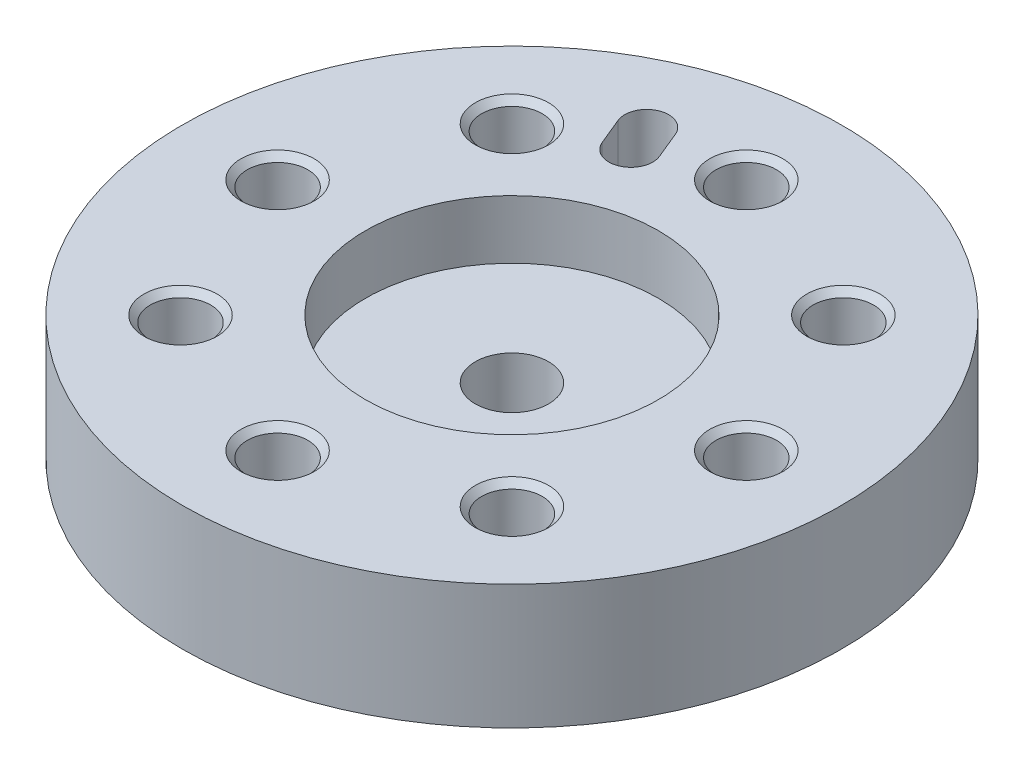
ISO-10303-21;
HEADER;
FILE_DESCRIPTION(('STEP AP214'),'2;1');
FILE_NAME('part.step','',(''),(''),'','','');
FILE_SCHEMA(('AUTOMOTIVE_DESIGN { 1 0 10303 214 1 1 1 1 }'));
ENDSEC;
DATA;
#1=APPLICATION_CONTEXT('core data for automotive mechanical design processes');
#2=APPLICATION_PROTOCOL_DEFINITION('international standard','automotive_design',2000,#1);
#3=PRODUCT_CONTEXT('',#1,'mechanical');
#4=PRODUCT('Part','Part','',(#3));
#5=PRODUCT_RELATED_PRODUCT_CATEGORY('part','',(#4));
#6=PRODUCT_DEFINITION_FORMATION('','',#4);
#7=PRODUCT_DEFINITION_CONTEXT('part definition',#1,'design');
#8=PRODUCT_DEFINITION('design','',#6,#7);
#9=PRODUCT_DEFINITION_SHAPE('','',#8);
#10=(LENGTH_UNIT() NAMED_UNIT(*) SI_UNIT(.MILLI.,.METRE.));
#11=(NAMED_UNIT(*) PLANE_ANGLE_UNIT() SI_UNIT($,.RADIAN.));
#12=(NAMED_UNIT(*) SI_UNIT($,.STERADIAN.) SOLID_ANGLE_UNIT());
#13=UNCERTAINTY_MEASURE_WITH_UNIT(LENGTH_MEASURE(1.E-05),#10,'distance_accuracy_value','');
#14=(GEOMETRIC_REPRESENTATION_CONTEXT(3) GLOBAL_UNCERTAINTY_ASSIGNED_CONTEXT((#13)) GLOBAL_UNIT_ASSIGNED_CONTEXT((#10,
#11,#12)) REPRESENTATION_CONTEXT('',''));
#15=CARTESIAN_POINT('',(0.,0.,0.));
#16=DIRECTION('',(0.,0.,1.));
#17=DIRECTION('',(1.,0.,0.));
#18=AXIS2_PLACEMENT_3D('',#15,#16,#17);
#19=CARTESIAN_POINT('',(0.,-8.,-16.));
#20=DIRECTION('',(0.,1.,0.));
#21=DIRECTION('',(0.,0.,1.));
#22=AXIS2_PLACEMENT_3D('',#19,#20,#21);
#23=PLANE('',#22);
#24=CARTESIAN_POINT('',(0.,-8.,-16.));
#25=DIRECTION('',(0.,-1.,0.));
#26=DIRECTION('',(0.,0.,-1.));
#27=AXIS2_PLACEMENT_3D('',#24,#25,#26);
#28=CIRCLE('',#27,2.067);
#29=CARTESIAN_POINT('',(0.,-8.,-18.067));
#30=VERTEX_POINT('',#29);
#31=EDGE_CURVE('E20',#30,#30,#28,.F.);
#32=ORIENTED_EDGE('',*,*,#31,.T.);
#33=EDGE_LOOP('',(#32));
#34=FACE_BOUND('',#33,.T.);
#35=ADVANCED_FACE('F17',(#34),#23,.T.);
#36=CARTESIAN_POINT('',(-16.,-8.,0.));
#37=DIRECTION('',(0.,1.,0.));
#38=DIRECTION('',(0.,0.,1.));
#39=AXIS2_PLACEMENT_3D('',#36,#37,#38);
#40=PLANE('',#39);
#41=CARTESIAN_POINT('',(-16.,-8.,0.));
#42=DIRECTION('',(0.,-1.,0.));
#43=DIRECTION('',(0.,0.,-1.));
#44=AXIS2_PLACEMENT_3D('',#41,#42,#43);
#45=CIRCLE('',#44,2.067);
#46=CARTESIAN_POINT('',(-16.,-8.,-2.067));
#47=VERTEX_POINT('',#46);
#48=EDGE_CURVE('E171',#47,#47,#45,.F.);
#49=ORIENTED_EDGE('',*,*,#48,.T.);
#50=EDGE_LOOP('',(#49));
#51=FACE_BOUND('',#50,.T.);
#52=ADVANCED_FACE('F300',(#51),#40,.T.);
#53=CARTESIAN_POINT('',(0.,-8.,16.));
#54=DIRECTION('',(0.,1.,0.));
#55=DIRECTION('',(0.,0.,1.));
#56=AXIS2_PLACEMENT_3D('',#53,#54,#55);
#57=PLANE('',#56);
#58=CARTESIAN_POINT('',(0.,-8.,16.));
#59=DIRECTION('',(0.,-1.,0.));
#60=DIRECTION('',(0.,0.,-1.));
#61=AXIS2_PLACEMENT_3D('',#58,#59,#60);
#62=CIRCLE('',#61,2.067);
#63=CARTESIAN_POINT('',(0.,-8.,13.933));
#64=VERTEX_POINT('',#63);
#65=EDGE_CURVE('E169',#64,#64,#62,.F.);
#66=ORIENTED_EDGE('',*,*,#65,.T.);
#67=EDGE_LOOP('',(#66));
#68=FACE_BOUND('',#67,.T.);
#69=ADVANCED_FACE('F297',(#68),#57,.T.);
#70=CARTESIAN_POINT('',(16.,-8.,0.));
#71=DIRECTION('',(0.,1.,0.));
#72=DIRECTION('',(0.,0.,1.));
#73=AXIS2_PLACEMENT_3D('',#70,#71,#72);
#74=PLANE('',#73);
#75=CARTESIAN_POINT('',(16.,-8.,0.));
#76=DIRECTION('',(0.,-1.,0.));
#77=DIRECTION('',(0.,0.,-1.));
#78=AXIS2_PLACEMENT_3D('',#75,#76,#77);
#79=CIRCLE('',#78,2.067);
#80=CARTESIAN_POINT('',(16.,-8.,-2.067));
#81=VERTEX_POINT('',#80);
#82=EDGE_CURVE('E166',#81,#81,#79,.F.);
#83=ORIENTED_EDGE('',*,*,#82,.T.);
#84=EDGE_LOOP('',(#83));
#85=FACE_BOUND('',#84,.T.);
#86=ADVANCED_FACE('F293',(#85),#74,.T.);
#87=CARTESIAN_POINT('',(11.3137084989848,-8.,11.3137084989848));
#88=DIRECTION('',(0.,1.,0.));
#89=DIRECTION('',(0.,0.,1.));
#90=AXIS2_PLACEMENT_3D('',#87,#88,#89);
#91=PLANE('',#90);
#92=CARTESIAN_POINT('',(11.3137084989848,-8.,11.3137084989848));
#93=DIRECTION('',(0.,-1.,0.));
#94=DIRECTION('',(0.,0.,-1.));
#95=AXIS2_PLACEMENT_3D('',#92,#93,#94);
#96=CIRCLE('',#95,2.067);
#97=CARTESIAN_POINT('',(11.3137084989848,-8.,9.24670849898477));
#98=VERTEX_POINT('',#97);
#99=EDGE_CURVE('E163',#98,#98,#96,.F.);
#100=ORIENTED_EDGE('',*,*,#99,.T.);
#101=EDGE_LOOP('',(#100));
#102=FACE_BOUND('',#101,.T.);
#103=ADVANCED_FACE('F289',(#102),#91,.T.);
#104=CARTESIAN_POINT('',(-11.3137084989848,-8.,11.3137084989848));
#105=DIRECTION('',(0.,1.,0.));
#106=DIRECTION('',(0.,0.,1.));
#107=AXIS2_PLACEMENT_3D('',#104,#105,#106);
#108=PLANE('',#107);
#109=CARTESIAN_POINT('',(-11.3137084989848,-8.,11.3137084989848));
#110=DIRECTION('',(0.,-1.,0.));
#111=DIRECTION('',(0.,0.,-1.));
#112=AXIS2_PLACEMENT_3D('',#109,#110,#111);
#113=CIRCLE('',#112,2.067);
#114=CARTESIAN_POINT('',(-11.3137084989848,-8.,9.24670849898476));
#115=VERTEX_POINT('',#114);
#116=EDGE_CURVE('E160',#115,#115,#113,.F.);
#117=ORIENTED_EDGE('',*,*,#116,.T.);
#118=EDGE_LOOP('',(#117));
#119=FACE_BOUND('',#118,.T.);
#120=ADVANCED_FACE('F285',(#119),#108,.T.);
#121=CARTESIAN_POINT('',(-11.3137084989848,-8.,-11.3137084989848));
#122=DIRECTION('',(0.,1.,0.));
#123=DIRECTION('',(0.,0.,1.));
#124=AXIS2_PLACEMENT_3D('',#121,#122,#123);
#125=PLANE('',#124);
#126=CARTESIAN_POINT('',(-11.3137084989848,-8.,-11.3137084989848));
#127=DIRECTION('',(0.,-1.,0.));
#128=DIRECTION('',(0.,0.,-1.));
#129=AXIS2_PLACEMENT_3D('',#126,#127,#128);
#130=CIRCLE('',#129,2.067);
#131=CARTESIAN_POINT('',(-11.3137084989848,-8.,-13.3807084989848));
#132=VERTEX_POINT('',#131);
#133=EDGE_CURVE('E157',#132,#132,#130,.F.);
#134=ORIENTED_EDGE('',*,*,#133,.T.);
#135=EDGE_LOOP('',(#134));
#136=FACE_BOUND('',#135,.T.);
#137=ADVANCED_FACE('F281',(#136),#125,.T.);
#138=CARTESIAN_POINT('',(11.3137084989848,-8.,-11.3137084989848));
#139=DIRECTION('',(0.,1.,0.));
#140=DIRECTION('',(0.,0.,1.));
#141=AXIS2_PLACEMENT_3D('',#138,#139,#140);
#142=PLANE('',#141);
#143=CARTESIAN_POINT('',(11.3137084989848,-8.,-11.3137084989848));
#144=DIRECTION('',(0.,-1.,0.));
#145=DIRECTION('',(0.,0.,-1.));
#146=AXIS2_PLACEMENT_3D('',#143,#144,#145);
#147=CIRCLE('',#146,2.067);
#148=CARTESIAN_POINT('',(11.3137084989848,-8.,-13.3807084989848));
#149=VERTEX_POINT('',#148);
#150=EDGE_CURVE('E67',#149,#149,#147,.F.);
#151=ORIENTED_EDGE('',*,*,#150,.T.);
#152=EDGE_LOOP('',(#151));
#153=FACE_BOUND('',#152,.T.);
#154=ADVANCED_FACE('F278',(#153),#142,.T.);
#155=CARTESIAN_POINT('',(-6.50561835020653,-3.5,-15.7059520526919));
#156=DIRECTION('',(0.,1.,0.));
#157=DIRECTION('',(0.,0.,1.));
#158=AXIS2_PLACEMENT_3D('',#155,#156,#157);
#159=PLANE('',#158);
#160=CARTESIAN_POINT('',(-5.74025148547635,-3.5,-13.8581929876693));
#161=DIRECTION('',(0.,1.,0.));
#162=DIRECTION('',(0.,0.,1.));
#163=AXIS2_PLACEMENT_3D('',#160,#161,#162);
#164=CIRCLE('',#163,1.5);
#165=CARTESIAN_POINT('',(-7.12607078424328,-3.5,-13.2841678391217));
#166=VERTEX_POINT('',#165);
#167=CARTESIAN_POINT('',(-4.35443218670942,-3.5,-14.4322181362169));
#168=VERTEX_POINT('',#167);
#169=EDGE_CURVE('E56',#166,#168,#164,.T.);
#170=ORIENTED_EDGE('',*,*,#169,.T.);
#171=DIRECTION('',(-0.38268343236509,0.,-0.923879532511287));
#172=VECTOR('',#171,1.);
#173=CARTESIAN_POINT('',(-4.35443218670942,-3.5,-14.4322181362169));
#174=LINE('',#173,#172);
#175=CARTESIAN_POINT('',(-5.1197990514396,-3.5,-16.2799772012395));
#176=VERTEX_POINT('',#175);
#177=EDGE_CURVE('E59',#168,#176,#174,.T.);
#178=ORIENTED_EDGE('',*,*,#177,.T.);
#179=CARTESIAN_POINT('',(-6.50561835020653,-3.5,-15.7059520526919));
#180=DIRECTION('',(0.,1.,0.));
#181=DIRECTION('',(0.,0.,1.));
#182=AXIS2_PLACEMENT_3D('',#179,#180,#181);
#183=CIRCLE('',#182,1.5);
#184=CARTESIAN_POINT('',(-7.89143764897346,-3.5,-15.1319269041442));
#185=VERTEX_POINT('',#184);
#186=EDGE_CURVE('E153',#176,#185,#183,.T.);
#187=ORIENTED_EDGE('',*,*,#186,.T.);
#188=DIRECTION('',(0.38268343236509,0.,0.923879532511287));
#189=VECTOR('',#188,1.);
#190=CARTESIAN_POINT('',(-7.89143764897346,-3.5,-15.1319269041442));
#191=LINE('',#190,#189);
#192=EDGE_CURVE('E61',#185,#166,#191,.T.);
#193=ORIENTED_EDGE('',*,*,#192,.T.);
#194=EDGE_LOOP('',(#170,#178,#187,#193));
#195=FACE_BOUND('',#194,.T.);
#196=ADVANCED_FACE('F58',(#195),#159,.T.);
#197=CARTESIAN_POINT('',(0.,0.,-16.));
#198=DIRECTION('',(0.,-1.,0.));
#199=DIRECTION('',(0.,0.,-1.));
#200=AXIS2_PLACEMENT_3D('',#197,#198,#199);
#201=CYLINDRICAL_SURFACE('',#200,2.067);
#202=ORIENTED_EDGE('',*,*,#31,.F.);
#203=EDGE_LOOP('',(#202));
#204=FACE_BOUND('',#203,.T.);
#205=CARTESIAN_POINT('',(0.,-0.432999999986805,-16.));
#206=DIRECTION('',(0.,1.,0.));
#207=DIRECTION('',(0.,0.,1.));
#208=AXIS2_PLACEMENT_3D('',#205,#206,#207);
#209=CIRCLE('',#208,2.06699999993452);
#210=CARTESIAN_POINT('',(0.,-0.432999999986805,-13.9330000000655));
#211=VERTEX_POINT('',#210);
#212=EDGE_CURVE('E105',#211,#211,#209,.T.);
#213=ORIENTED_EDGE('',*,*,#212,.T.);
#214=EDGE_LOOP('',(#213));
#215=FACE_BOUND('',#214,.T.);
#216=ADVANCED_FACE('F179',(#204,#215),#201,.F.);
#217=CARTESIAN_POINT('',(-16.,0.,0.));
#218=DIRECTION('',(0.,-1.,0.));
#219=DIRECTION('',(0.,0.,-1.));
#220=AXIS2_PLACEMENT_3D('',#217,#218,#219);
#221=CYLINDRICAL_SURFACE('',#220,2.067);
#222=ORIENTED_EDGE('',*,*,#48,.F.);
#223=EDGE_LOOP('',(#222));
#224=FACE_BOUND('',#223,.T.);
#225=CARTESIAN_POINT('',(-16.,-0.432999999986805,0.));
#226=DIRECTION('',(0.,1.,0.));
#227=DIRECTION('',(0.,0.,1.));
#228=AXIS2_PLACEMENT_3D('',#225,#226,#227);
#229=CIRCLE('',#228,2.06700000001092);
#230=CARTESIAN_POINT('',(-16.,-0.432999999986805,2.06700000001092));
#231=VERTEX_POINT('',#230);
#232=EDGE_CURVE('E102',#231,#231,#229,.T.);
#233=ORIENTED_EDGE('',*,*,#232,.T.);
#234=EDGE_LOOP('',(#233));
#235=FACE_BOUND('',#234,.T.);
#236=ADVANCED_FACE('F182',(#224,#235),#221,.F.);
#237=CARTESIAN_POINT('',(0.,0.,16.));
#238=DIRECTION('',(0.,-1.,0.));
#239=DIRECTION('',(0.,0.,-1.));
#240=AXIS2_PLACEMENT_3D('',#237,#238,#239);
#241=CYLINDRICAL_SURFACE('',#240,2.067);
#242=ORIENTED_EDGE('',*,*,#65,.F.);
#243=EDGE_LOOP('',(#242));
#244=FACE_BOUND('',#243,.T.);
#245=CARTESIAN_POINT('',(0.,-0.432999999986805,16.));
#246=DIRECTION('',(0.,1.,0.));
#247=DIRECTION('',(0.,0.,1.));
#248=AXIS2_PLACEMENT_3D('',#245,#246,#247);
#249=CIRCLE('',#248,2.06699999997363);
#250=CARTESIAN_POINT('',(0.,-0.432999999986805,18.0669999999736));
#251=VERTEX_POINT('',#250);
#252=EDGE_CURVE('E99',#251,#251,#249,.T.);
#253=ORIENTED_EDGE('',*,*,#252,.T.);
#254=EDGE_LOOP('',(#253));
#255=FACE_BOUND('',#254,.T.);
#256=ADVANCED_FACE('F259',(#244,#255),#241,.F.);
#257=CARTESIAN_POINT('',(16.,0.,0.));
#258=DIRECTION('',(0.,-1.,0.));
#259=DIRECTION('',(0.,0.,-1.));
#260=AXIS2_PLACEMENT_3D('',#257,#258,#259);
#261=CYLINDRICAL_SURFACE('',#260,2.067);
#262=ORIENTED_EDGE('',*,*,#82,.F.);
#263=EDGE_LOOP('',(#262));
#264=FACE_BOUND('',#263,.T.);
#265=CARTESIAN_POINT('',(16.,-0.432999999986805,0.));
#266=DIRECTION('',(0.,1.,0.));
#267=DIRECTION('',(0.,0.,1.));
#268=AXIS2_PLACEMENT_3D('',#265,#266,#267);
#269=CIRCLE('',#268,2.06699999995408);
#270=CARTESIAN_POINT('',(16.,-0.432999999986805,2.06699999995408));
#271=VERTEX_POINT('',#270);
#272=EDGE_CURVE('E96',#271,#271,#269,.T.);
#273=ORIENTED_EDGE('',*,*,#272,.T.);
#274=EDGE_LOOP('',(#273));
#275=FACE_BOUND('',#274,.T.);
#276=ADVANCED_FACE('F261',(#264,#275),#261,.F.);
#277=CARTESIAN_POINT('',(11.3137084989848,0.,11.3137084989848));
#278=DIRECTION('',(0.,-1.,0.));
#279=DIRECTION('',(0.,0.,-1.));
#280=AXIS2_PLACEMENT_3D('',#277,#278,#279);
#281=CYLINDRICAL_SURFACE('',#280,2.067);
#282=ORIENTED_EDGE('',*,*,#99,.F.);
#283=EDGE_LOOP('',(#282));
#284=FACE_BOUND('',#283,.T.);
#285=CARTESIAN_POINT('',(11.3137084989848,-0.432999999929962,11.3137084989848));
#286=DIRECTION('',(0.,1.,0.));
#287=DIRECTION('',(0.,0.,1.));
#288=AXIS2_PLACEMENT_3D('',#285,#286,#287);
#289=CIRCLE('',#288,2.06700000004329);
#290=CARTESIAN_POINT('',(11.3137084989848,-0.432999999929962,13.3807084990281));
#291=VERTEX_POINT('',#290);
#292=EDGE_CURVE('E93',#291,#291,#289,.T.);
#293=ORIENTED_EDGE('',*,*,#292,.T.);
#294=EDGE_LOOP('',(#293));
#295=FACE_BOUND('',#294,.T.);
#296=ADVANCED_FACE('F268',(#284,#295),#281,.F.);
#297=CARTESIAN_POINT('',(-11.3137084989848,0.,11.3137084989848));
#298=DIRECTION('',(0.,-1.,0.));
#299=DIRECTION('',(0.,0.,-1.));
#300=AXIS2_PLACEMENT_3D('',#297,#298,#299);
#301=CYLINDRICAL_SURFACE('',#300,2.067);
#302=ORIENTED_EDGE('',*,*,#116,.F.);
#303=EDGE_LOOP('',(#302));
#304=FACE_BOUND('',#303,.T.);
#305=CARTESIAN_POINT('',(-11.3137084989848,-0.432999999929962,11.3137084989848));
#306=DIRECTION('',(0.,1.,0.));
#307=DIRECTION('',(0.,0.,1.));
#308=AXIS2_PLACEMENT_3D('',#305,#306,#307);
#309=CIRCLE('',#308,2.0670000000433);
#310=CARTESIAN_POINT('',(-11.3137084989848,-0.432999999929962,13.3807084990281));
#311=VERTEX_POINT('',#310);
#312=EDGE_CURVE('E90',#311,#311,#309,.T.);
#313=ORIENTED_EDGE('',*,*,#312,.T.);
#314=EDGE_LOOP('',(#313));
#315=FACE_BOUND('',#314,.T.);
#316=ADVANCED_FACE('F391',(#304,#315),#301,.F.);
#317=CARTESIAN_POINT('',(-11.3137084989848,0.,-11.3137084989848));
#318=DIRECTION('',(0.,-1.,0.));
#319=DIRECTION('',(0.,0.,-1.));
#320=AXIS2_PLACEMENT_3D('',#317,#318,#319);
#321=CYLINDRICAL_SURFACE('',#320,2.067);
#322=ORIENTED_EDGE('',*,*,#133,.F.);
#323=EDGE_LOOP('',(#322));
#324=FACE_BOUND('',#323,.T.);
#325=CARTESIAN_POINT('',(-11.3137084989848,-0.432999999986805,-11.3137084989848));
#326=DIRECTION('',(0.,1.,0.));
#327=DIRECTION('',(0.,0.,1.));
#328=AXIS2_PLACEMENT_3D('',#325,#326,#327);
#329=CIRCLE('',#328,2.06699999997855);
#330=CARTESIAN_POINT('',(-11.3137084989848,-0.432999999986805,-9.24670849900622));
#331=VERTEX_POINT('',#330);
#332=EDGE_CURVE('E87',#331,#331,#329,.T.);
#333=ORIENTED_EDGE('',*,*,#332,.T.);
#334=EDGE_LOOP('',(#333));
#335=FACE_BOUND('',#334,.T.);
#336=ADVANCED_FACE('F400',(#324,#335),#321,.F.);
#337=CARTESIAN_POINT('',(11.3137084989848,0.,-11.3137084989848));
#338=DIRECTION('',(0.,-1.,0.));
#339=DIRECTION('',(0.,0.,-1.));
#340=AXIS2_PLACEMENT_3D('',#337,#338,#339);
#341=CYLINDRICAL_SURFACE('',#340,2.067);
#342=ORIENTED_EDGE('',*,*,#150,.F.);
#343=EDGE_LOOP('',(#342));
#344=FACE_BOUND('',#343,.T.);
#345=CARTESIAN_POINT('',(11.3137084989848,-0.432999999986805,-11.3137084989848));
#346=DIRECTION('',(0.,1.,0.));
#347=DIRECTION('',(0.,0.,1.));
#348=AXIS2_PLACEMENT_3D('',#345,#346,#347);
#349=CIRCLE('',#348,2.06699999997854);
#350=CARTESIAN_POINT('',(11.3137084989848,-0.432999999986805,-9.24670849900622));
#351=VERTEX_POINT('',#350);
#352=EDGE_CURVE('E83',#351,#351,#349,.T.);
#353=ORIENTED_EDGE('',*,*,#352,.T.);
#354=EDGE_LOOP('',(#353));
#355=FACE_BOUND('',#354,.T.);
#356=ADVANCED_FACE('F410',(#344,#355),#341,.F.);
#357=CARTESIAN_POINT('',(-5.74025148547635,-3.5,-13.8581929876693));
#358=DIRECTION('',(0.,1.,0.));
#359=DIRECTION('',(0.,0.,1.));
#360=AXIS2_PLACEMENT_3D('',#357,#358,#359);
#361=CYLINDRICAL_SURFACE('',#360,1.5);
#362=ORIENTED_EDGE('',*,*,#169,.F.);
#363=DIRECTION('',(0.,1.,0.));
#364=VECTOR('',#363,1.);
#365=CARTESIAN_POINT('',(-7.12607078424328,-3.5,-13.2841678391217));
#366=LINE('',#365,#364);
#367=CARTESIAN_POINT('',(-7.12607078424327,0.,-13.2841678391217));
#368=VERTEX_POINT('',#367);
#369=EDGE_CURVE('E108',#166,#368,#366,.T.);
#370=ORIENTED_EDGE('',*,*,#369,.T.);
#371=CARTESIAN_POINT('',(-5.74025148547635,0.,-13.8581929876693));
#372=DIRECTION('',(0.,1.,0.));
#373=DIRECTION('',(0.,0.,1.));
#374=AXIS2_PLACEMENT_3D('',#371,#372,#373);
#375=CIRCLE('',#374,1.5);
#376=CARTESIAN_POINT('',(-4.35443218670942,0.,-14.4322181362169));
#377=VERTEX_POINT('',#376);
#378=EDGE_CURVE('E78',#368,#377,#375,.T.);
#379=ORIENTED_EDGE('',*,*,#378,.T.);
#380=DIRECTION('',(0.,1.,0.));
#381=VECTOR('',#380,1.);
#382=CARTESIAN_POINT('',(-4.35443218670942,-3.5,-14.4322181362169));
#383=LINE('',#382,#381);
#384=EDGE_CURVE('E66',#377,#168,#383,.F.);
#385=ORIENTED_EDGE('',*,*,#384,.T.);
#386=EDGE_LOOP('',(#362,#370,#379,#385));
#387=FACE_BOUND('',#386,.T.);
#388=ADVANCED_FACE('F77',(#387),#361,.F.);
#389=CARTESIAN_POINT('',(-4.35443218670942,-3.5,-14.4322181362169));
#390=DIRECTION('',(0.923879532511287,0.,-0.38268343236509));
#391=DIRECTION('',(-0.38268343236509,0.,-0.923879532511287));
#392=AXIS2_PLACEMENT_3D('',#389,#390,#391);
#393=PLANE('',#392);
#394=DIRECTION('',(0.,1.,0.));
#395=VECTOR('',#394,1.);
#396=CARTESIAN_POINT('',(-5.1197990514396,-3.5,-16.2799772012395));
#397=LINE('',#396,#395);
#398=CARTESIAN_POINT('',(-5.1197990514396,0.,-16.2799772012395));
#399=VERTEX_POINT('',#398);
#400=EDGE_CURVE('E74',#399,#176,#397,.F.);
#401=ORIENTED_EDGE('',*,*,#400,.T.);
#402=ORIENTED_EDGE('',*,*,#177,.F.);
#403=ORIENTED_EDGE('',*,*,#384,.F.);
#404=DIRECTION('',(-0.38268343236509,0.,-0.923879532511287));
#405=VECTOR('',#404,1.);
#406=CARTESIAN_POINT('',(-4.35443218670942,0.,-14.4322181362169));
#407=LINE('',#406,#405);
#408=EDGE_CURVE('E149',#377,#399,#407,.T.);
#409=ORIENTED_EDGE('',*,*,#408,.T.);
#410=EDGE_LOOP('',(#401,#402,#403,#409));
#411=FACE_BOUND('',#410,.T.);
#412=ADVANCED_FACE('F71',(#411),#393,.F.);
#413=CARTESIAN_POINT('',(-6.50561835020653,-3.5,-15.7059520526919));
#414=DIRECTION('',(0.,1.,0.));
#415=DIRECTION('',(0.,0.,1.));
#416=AXIS2_PLACEMENT_3D('',#413,#414,#415);
#417=CYLINDRICAL_SURFACE('',#416,1.5);
#418=DIRECTION('',(0.,1.,0.));
#419=VECTOR('',#418,1.);
#420=CARTESIAN_POINT('',(-7.89143764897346,-3.5,-15.1319269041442));
#421=LINE('',#420,#419);
#422=CARTESIAN_POINT('',(-7.89143764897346,0.,-15.1319269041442));
#423=VERTEX_POINT('',#422);
#424=EDGE_CURVE('E35',#423,#185,#421,.F.);
#425=ORIENTED_EDGE('',*,*,#424,.T.);
#426=ORIENTED_EDGE('',*,*,#186,.F.);
#427=ORIENTED_EDGE('',*,*,#400,.F.);
#428=CARTESIAN_POINT('',(-6.50561835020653,0.,-15.7059520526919));
#429=DIRECTION('',(0.,1.,0.));
#430=DIRECTION('',(0.,0.,1.));
#431=AXIS2_PLACEMENT_3D('',#428,#429,#430);
#432=CIRCLE('',#431,1.5);
#433=EDGE_CURVE('E146',#399,#423,#432,.T.);
#434=ORIENTED_EDGE('',*,*,#433,.T.);
#435=EDGE_LOOP('',(#425,#426,#427,#434));
#436=FACE_BOUND('',#435,.T.);
#437=ADVANCED_FACE('F200',(#436),#417,.F.);
#438=CARTESIAN_POINT('',(-7.89143764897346,-3.5,-15.1319269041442));
#439=DIRECTION('',(-0.923879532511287,0.,0.38268343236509));
#440=DIRECTION('',(0.38268343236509,0.,0.923879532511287));
#441=AXIS2_PLACEMENT_3D('',#438,#439,#440);
#442=PLANE('',#441);
#443=ORIENTED_EDGE('',*,*,#369,.F.);
#444=ORIENTED_EDGE('',*,*,#192,.F.);
#445=ORIENTED_EDGE('',*,*,#424,.F.);
#446=DIRECTION('',(0.382683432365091,0.,0.923879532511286));
#447=VECTOR('',#446,1.);
#448=CARTESIAN_POINT('',(-7.89143764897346,0.,-15.1319269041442));
#449=LINE('',#448,#447);
#450=EDGE_CURVE('E145',#423,#368,#449,.T.);
#451=ORIENTED_EDGE('',*,*,#450,.T.);
#452=EDGE_LOOP('',(#443,#444,#445,#451));
#453=FACE_BOUND('',#452,.T.);
#454=ADVANCED_FACE('F189',(#453),#442,.F.);
#455=CARTESIAN_POINT('',(0.,0.,-16.));
#456=DIRECTION('',(0.,1.,0.));
#457=DIRECTION('',(0.,0.,1.));
#458=AXIS2_PLACEMENT_3D('',#455,#456,#457);
#459=CONICAL_SURFACE('',#458,2.49999999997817,0.785398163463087);
#460=CARTESIAN_POINT('',(0.,1.95538030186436E-11,-16.));
#461=DIRECTION('',(0.,1.,0.));
#462=DIRECTION('',(0.,0.,1.));
#463=AXIS2_PLACEMENT_3D('',#460,#461,#462);
#464=CIRCLE('',#463,2.49999999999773);
#465=CARTESIAN_POINT('',(0.,1.95538030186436E-11,-13.5000000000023));
#466=VERTEX_POINT('',#465);
#467=EDGE_CURVE('E142',#466,#466,#464,.T.);
#468=ORIENTED_EDGE('',*,*,#467,.T.);
#469=EDGE_LOOP('',(#468));
#470=FACE_BOUND('',#469,.T.);
#471=ORIENTED_EDGE('',*,*,#212,.F.);
#472=EDGE_LOOP('',(#471));
#473=FACE_BOUND('',#472,.T.);
#474=ADVANCED_FACE('F186',(#470,#473),#459,.F.);
#475=CARTESIAN_POINT('',(-16.,-5.6843418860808E-11,0.));
#476=DIRECTION('',(0.,1.,0.));
#477=DIRECTION('',(0.,0.,1.));
#478=AXIS2_PLACEMENT_3D('',#475,#476,#477);
#479=CONICAL_SURFACE('',#478,2.49999999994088,0.785398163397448);
#480=CARTESIAN_POINT('',(-16.,0.,0.));
#481=DIRECTION('',(0.,1.,0.));
#482=DIRECTION('',(0.,0.,1.));
#483=AXIS2_PLACEMENT_3D('',#480,#481,#482);
#484=CIRCLE('',#483,2.49999999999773);
#485=CARTESIAN_POINT('',(-16.,0.,2.49999999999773));
#486=VERTEX_POINT('',#485);
#487=EDGE_CURVE('E139',#486,#486,#484,.T.);
#488=ORIENTED_EDGE('',*,*,#487,.T.);
#489=EDGE_LOOP('',(#488));
#490=FACE_BOUND('',#489,.T.);
#491=ORIENTED_EDGE('',*,*,#232,.F.);
#492=EDGE_LOOP('',(#491));
#493=FACE_BOUND('',#492,.T.);
#494=ADVANCED_FACE('F188',(#490,#493),#479,.F.);
#495=CARTESIAN_POINT('',(0.,5.6843418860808E-11,16.));
#496=DIRECTION('',(0.,1.,0.));
#497=DIRECTION('',(0.,0.,1.));
#498=AXIS2_PLACEMENT_3D('',#495,#496,#497);
#499=CONICAL_SURFACE('',#498,2.49999999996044,0.785398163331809);
#500=CARTESIAN_POINT('',(0.,5.6843418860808E-11,16.));
#501=DIRECTION('',(0.,1.,0.));
#502=DIRECTION('',(0.,0.,1.));
#503=AXIS2_PLACEMENT_3D('',#500,#501,#502);
#504=CIRCLE('',#503,2.49999999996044);
#505=CARTESIAN_POINT('',(0.,5.6843418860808E-11,18.4999999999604));
#506=VERTEX_POINT('',#505);
#507=EDGE_CURVE('E136',#506,#506,#504,.T.);
#508=ORIENTED_EDGE('',*,*,#507,.T.);
#509=EDGE_LOOP('',(#508));
#510=FACE_BOUND('',#509,.T.);
#511=ORIENTED_EDGE('',*,*,#252,.F.);
#512=EDGE_LOOP('',(#511));
#513=FACE_BOUND('',#512,.T.);
#514=ADVANCED_FACE('F197',(#510,#513),#499,.F.);
#515=CARTESIAN_POINT('',(16.,1.13686837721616E-10,0.));
#516=DIRECTION('',(0.,1.,0.));
#517=DIRECTION('',(0.,0.,1.));
#518=AXIS2_PLACEMENT_3D('',#515,#516,#517);
#519=CONICAL_SURFACE('',#518,2.50000000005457,0.785398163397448);
#520=CARTESIAN_POINT('',(16.,0.,0.));
#521=DIRECTION('',(0.,1.,0.));
#522=DIRECTION('',(0.,0.,1.));
#523=AXIS2_PLACEMENT_3D('',#520,#521,#522);
#524=CIRCLE('',#523,2.49999999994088);
#525=CARTESIAN_POINT('',(16.,0.,2.49999999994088));
#526=VERTEX_POINT('',#525);
#527=EDGE_CURVE('E133',#526,#526,#524,.T.);
#528=ORIENTED_EDGE('',*,*,#527,.T.);
#529=EDGE_LOOP('',(#528));
#530=FACE_BOUND('',#529,.T.);
#531=ORIENTED_EDGE('',*,*,#272,.F.);
#532=EDGE_LOOP('',(#531));
#533=FACE_BOUND('',#532,.T.);
#534=ADVANCED_FACE('F246',(#530,#533),#519,.F.);
#535=CARTESIAN_POINT('',(0.,-8.5,0.));
#536=DIRECTION('',(0.,1.,0.));
#537=DIRECTION('',(0.,0.,1.));
#538=AXIS2_PLACEMENT_3D('',#535,#536,#537);
#539=CYLINDRICAL_SURFACE('',#538,10.);
#540=CARTESIAN_POINT('',(0.,-4.,0.));
#541=DIRECTION('',(0.,1.,0.));
#542=DIRECTION('',(0.,0.,1.));
#543=AXIS2_PLACEMENT_3D('',#540,#541,#542);
#544=CIRCLE('',#543,10.);
#545=CARTESIAN_POINT('',(0.,-4.,10.));
#546=VERTEX_POINT('',#545);
#547=EDGE_CURVE('E86',#546,#546,#544,.F.);
#548=ORIENTED_EDGE('',*,*,#547,.T.);
#549=EDGE_LOOP('',(#548));
#550=FACE_BOUND('',#549,.T.);
#551=CARTESIAN_POINT('',(0.,0.,0.));
#552=DIRECTION('',(0.,1.,0.));
#553=DIRECTION('',(0.,0.,1.));
#554=AXIS2_PLACEMENT_3D('',#551,#552,#553);
#555=CIRCLE('',#554,10.);
#556=CARTESIAN_POINT('',(0.,0.,10.));
#557=VERTEX_POINT('',#556);
#558=EDGE_CURVE('E130',#557,#557,#555,.T.);
#559=ORIENTED_EDGE('',*,*,#558,.T.);
#560=EDGE_LOOP('',(#559));
#561=FACE_BOUND('',#560,.T.);
#562=ADVANCED_FACE('F242',(#550,#561),#539,.F.);
#563=CARTESIAN_POINT('',(11.3137084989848,0.,11.3137084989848));
#564=DIRECTION('',(0.,1.,0.));
#565=DIRECTION('',(0.,0.,1.));
#566=AXIS2_PLACEMENT_3D('',#563,#564,#565);
#567=CONICAL_SURFACE('',#566,2.49999999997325,0.785398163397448);
#568=CARTESIAN_POINT('',(11.3137084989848,0.,11.3137084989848));
#569=DIRECTION('',(0.,1.,0.));
#570=DIRECTION('',(0.,0.,1.));
#571=AXIS2_PLACEMENT_3D('',#568,#569,#570);
#572=CIRCLE('',#571,2.49999999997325);
#573=CARTESIAN_POINT('',(11.3137084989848,0.,13.813708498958));
#574=VERTEX_POINT('',#573);
#575=EDGE_CURVE('E127',#574,#574,#572,.T.);
#576=ORIENTED_EDGE('',*,*,#575,.T.);
#577=EDGE_LOOP('',(#576));
#578=FACE_BOUND('',#577,.T.);
#579=ORIENTED_EDGE('',*,*,#292,.F.);
#580=EDGE_LOOP('',(#579));
#581=FACE_BOUND('',#580,.T.);
#582=ADVANCED_FACE('F238',(#578,#581),#567,.F.);
#583=CARTESIAN_POINT('',(-11.3137084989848,0.,11.3137084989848));
#584=DIRECTION('',(0.,1.,0.));
#585=DIRECTION('',(0.,0.,1.));
#586=AXIS2_PLACEMENT_3D('',#583,#584,#585);
#587=CONICAL_SURFACE('',#586,2.49999999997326,0.785398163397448);
#588=CARTESIAN_POINT('',(-11.3137084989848,0.,11.3137084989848));
#589=DIRECTION('',(0.,1.,0.));
#590=DIRECTION('',(0.,0.,1.));
#591=AXIS2_PLACEMENT_3D('',#588,#589,#590);
#592=CIRCLE('',#591,2.49999999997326);
#593=CARTESIAN_POINT('',(-11.3137084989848,0.,13.813708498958));
#594=VERTEX_POINT('',#593);
#595=EDGE_CURVE('E124',#594,#594,#592,.T.);
#596=ORIENTED_EDGE('',*,*,#595,.T.);
#597=EDGE_LOOP('',(#596));
#598=FACE_BOUND('',#597,.T.);
#599=ORIENTED_EDGE('',*,*,#312,.F.);
#600=EDGE_LOOP('',(#599));
#601=FACE_BOUND('',#600,.T.);
#602=ADVANCED_FACE('F234',(#598,#601),#587,.F.);
#603=CARTESIAN_POINT('',(-11.3137084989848,0.,-11.3137084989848));
#604=DIRECTION('',(0.,1.,0.));
#605=DIRECTION('',(0.,0.,1.));
#606=AXIS2_PLACEMENT_3D('',#603,#604,#605);
#607=CONICAL_SURFACE('',#606,2.50000000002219,0.785398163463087);
#608=CARTESIAN_POINT('',(-11.3137084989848,-2.44682746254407E-11,-11.3137084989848));
#609=DIRECTION('',(0.,1.,0.));
#610=DIRECTION('',(0.,0.,1.));
#611=AXIS2_PLACEMENT_3D('',#608,#609,#610);
#612=CIRCLE('',#611,2.49999999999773);
#613=CARTESIAN_POINT('',(-11.3137084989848,-2.44682746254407E-11,-8.81370849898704));
#614=VERTEX_POINT('',#613);
#615=EDGE_CURVE('E121',#614,#614,#612,.T.);
#616=ORIENTED_EDGE('',*,*,#615,.T.);
#617=EDGE_LOOP('',(#616));
#618=FACE_BOUND('',#617,.T.);
#619=ORIENTED_EDGE('',*,*,#332,.F.);
#620=EDGE_LOOP('',(#619));
#621=FACE_BOUND('',#620,.T.);
#622=ADVANCED_FACE('F230',(#618,#621),#607,.F.);
#623=CARTESIAN_POINT('',(11.3137084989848,0.,-11.3137084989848));
#624=DIRECTION('',(0.,1.,0.));
#625=DIRECTION('',(0.,0.,1.));
#626=AXIS2_PLACEMENT_3D('',#623,#624,#625);
#627=CONICAL_SURFACE('',#626,2.50000000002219,0.785398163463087);
#628=CARTESIAN_POINT('',(11.3137084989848,-2.44648051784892E-11,-11.3137084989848));
#629=DIRECTION('',(0.,1.,0.));
#630=DIRECTION('',(0.,0.,1.));
#631=AXIS2_PLACEMENT_3D('',#628,#629,#630);
#632=CIRCLE('',#631,2.49999999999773);
#633=CARTESIAN_POINT('',(11.3137084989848,-2.44648051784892E-11,-8.81370849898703));
#634=VERTEX_POINT('',#633);
#635=EDGE_CURVE('E118',#634,#634,#632,.T.);
#636=ORIENTED_EDGE('',*,*,#635,.T.);
#637=EDGE_LOOP('',(#636));
#638=FACE_BOUND('',#637,.T.);
#639=ORIENTED_EDGE('',*,*,#352,.F.);
#640=EDGE_LOOP('',(#639));
#641=FACE_BOUND('',#640,.T.);
#642=ADVANCED_FACE('F226',(#638,#641),#627,.F.);
#643=CARTESIAN_POINT('',(0.,-4.,0.));
#644=DIRECTION('',(0.,-1.,0.));
#645=DIRECTION('',(0.,0.,-1.));
#646=AXIS2_PLACEMENT_3D('',#643,#644,#645);
#647=PLANE('',#646);
#648=ORIENTED_EDGE('',*,*,#547,.F.);
#649=EDGE_LOOP('',(#648));
#650=FACE_BOUND('',#649,.T.);
#651=CARTESIAN_POINT('',(0.,-4.,0.));
#652=DIRECTION('',(0.,1.,0.));
#653=DIRECTION('',(0.,0.,1.));
#654=AXIS2_PLACEMENT_3D('',#651,#652,#653);
#655=CIRCLE('',#654,2.5);
#656=CARTESIAN_POINT('',(0.,-4.,2.5));
#657=VERTEX_POINT('',#656);
#658=EDGE_CURVE('E115',#657,#657,#655,.F.);
#659=ORIENTED_EDGE('',*,*,#658,.T.);
#660=EDGE_LOOP('',(#659));
#661=FACE_BOUND('',#660,.T.);
#662=ADVANCED_FACE('F222',(#650,#661),#647,.F.);
#663=CARTESIAN_POINT('',(10.,0.,0.));
#664=DIRECTION('',(0.,-1.,0.));
#665=DIRECTION('',(0.,0.,-1.));
#666=AXIS2_PLACEMENT_3D('',#663,#664,#665);
#667=PLANE('',#666);
#668=ORIENTED_EDGE('',*,*,#635,.F.);
#669=EDGE_LOOP('',(#668));
#670=FACE_BOUND('',#669,.T.);
#671=ORIENTED_EDGE('',*,*,#615,.F.);
#672=EDGE_LOOP('',(#671));
#673=FACE_BOUND('',#672,.T.);
#674=ORIENTED_EDGE('',*,*,#595,.F.);
#675=EDGE_LOOP('',(#674));
#676=FACE_BOUND('',#675,.T.);
#677=ORIENTED_EDGE('',*,*,#575,.F.);
#678=EDGE_LOOP('',(#677));
#679=FACE_BOUND('',#678,.T.);
#680=CARTESIAN_POINT('',(0.,0.,0.));
#681=DIRECTION('',(0.,1.,0.));
#682=DIRECTION('',(0.,0.,1.));
#683=AXIS2_PLACEMENT_3D('',#680,#681,#682);
#684=CIRCLE('',#683,22.5);
#685=CARTESIAN_POINT('',(0.,0.,22.5));
#686=VERTEX_POINT('',#685);
#687=EDGE_CURVE('E112',#686,#686,#684,.F.);
#688=ORIENTED_EDGE('',*,*,#687,.F.);
#689=EDGE_LOOP('',(#688));
#690=FACE_BOUND('',#689,.T.);
#691=ORIENTED_EDGE('',*,*,#558,.F.);
#692=EDGE_LOOP('',(#691));
#693=FACE_BOUND('',#692,.T.);
#694=ORIENTED_EDGE('',*,*,#527,.F.);
#695=EDGE_LOOP('',(#694));
#696=FACE_BOUND('',#695,.T.);
#697=ORIENTED_EDGE('',*,*,#507,.F.);
#698=EDGE_LOOP('',(#697));
#699=FACE_BOUND('',#698,.T.);
#700=ORIENTED_EDGE('',*,*,#487,.F.);
#701=EDGE_LOOP('',(#700));
#702=FACE_BOUND('',#701,.T.);
#703=ORIENTED_EDGE('',*,*,#467,.F.);
#704=EDGE_LOOP('',(#703));
#705=FACE_BOUND('',#704,.T.);
#706=ORIENTED_EDGE('',*,*,#433,.F.);
#707=ORIENTED_EDGE('',*,*,#408,.F.);
#708=ORIENTED_EDGE('',*,*,#378,.F.);
#709=ORIENTED_EDGE('',*,*,#450,.F.);
#710=EDGE_LOOP('',(#706,#707,#708,#709));
#711=FACE_BOUND('',#710,.T.);
#712=ADVANCED_FACE('F218',(#670,#673,#676,#679,#690,#693,#696,#699,#702,#705,#711),#667,.F.);
#713=CARTESIAN_POINT('',(0.,-13.,0.));
#714=DIRECTION('',(0.,1.,0.));
#715=DIRECTION('',(0.,0.,1.));
#716=AXIS2_PLACEMENT_3D('',#713,#714,#715);
#717=CYLINDRICAL_SURFACE('',#716,2.5);
#718=CARTESIAN_POINT('',(0.,-8.5,0.));
#719=DIRECTION('',(0.,1.,0.));
#720=DIRECTION('',(0.,0.,1.));
#721=AXIS2_PLACEMENT_3D('',#718,#719,#720);
#722=CIRCLE('',#721,2.5);
#723=CARTESIAN_POINT('',(0.,-8.5,2.5));
#724=VERTEX_POINT('',#723);
#725=EDGE_CURVE('E26',#724,#724,#722,.F.);
#726=ORIENTED_EDGE('',*,*,#725,.T.);
#727=EDGE_LOOP('',(#726));
#728=FACE_BOUND('',#727,.T.);
#729=ORIENTED_EDGE('',*,*,#658,.F.);
#730=EDGE_LOOP('',(#729));
#731=FACE_BOUND('',#730,.T.);
#732=ADVANCED_FACE('F210',(#728,#731),#717,.F.);
#733=CARTESIAN_POINT('',(0.,-8.5,0.));
#734=DIRECTION('',(0.,1.,0.));
#735=DIRECTION('',(0.,0.,1.));
#736=AXIS2_PLACEMENT_3D('',#733,#734,#735);
#737=CYLINDRICAL_SURFACE('',#736,22.5);
#738=ORIENTED_EDGE('',*,*,#687,.T.);
#739=EDGE_LOOP('',(#738));
#740=FACE_BOUND('',#739,.T.);
#741=CARTESIAN_POINT('',(0.,-8.5,0.));
#742=DIRECTION('',(0.,1.,0.));
#743=DIRECTION('',(0.,0.,1.));
#744=AXIS2_PLACEMENT_3D('',#741,#742,#743);
#745=CIRCLE('',#744,22.5);
#746=CARTESIAN_POINT('',(0.,-8.5,22.5));
#747=VERTEX_POINT('',#746);
#748=EDGE_CURVE('E11',#747,#747,#745,.T.);
#749=ORIENTED_EDGE('',*,*,#748,.T.);
#750=EDGE_LOOP('',(#749));
#751=FACE_BOUND('',#750,.T.);
#752=ADVANCED_FACE('F204',(#740,#751),#737,.T.);
#753=CARTESIAN_POINT('',(22.5,-8.5,0.));
#754=DIRECTION('',(0.,1.,0.));
#755=DIRECTION('',(0.,0.,1.));
#756=AXIS2_PLACEMENT_3D('',#753,#754,#755);
#757=PLANE('',#756);
#758=ORIENTED_EDGE('',*,*,#748,.F.);
#759=EDGE_LOOP('',(#758));
#760=FACE_BOUND('',#759,.T.);
#761=ORIENTED_EDGE('',*,*,#725,.F.);
#762=EDGE_LOOP('',(#761));
#763=FACE_BOUND('',#762,.T.);
#764=ADVANCED_FACE('F202',(#760,#763),#757,.F.);
#765=CLOSED_SHELL('',(#35,#52,#69,#86,#103,#120,#137,#154,#196,#216,#236,#256,#276,#296,#316,
#336,#356,#388,#412,#437,#454,#474,#494,#514,#534,#562,#582,#602,#622,#642,#662,#712,#732,#752,#764));
#766=MANIFOLD_SOLID_BREP('B1',#765);
#767=ADVANCED_BREP_SHAPE_REPRESENTATION('',(#18,#766),#14);
#768=SHAPE_DEFINITION_REPRESENTATION(#9,#767);
ENDSEC;
END-ISO-10303-21;
